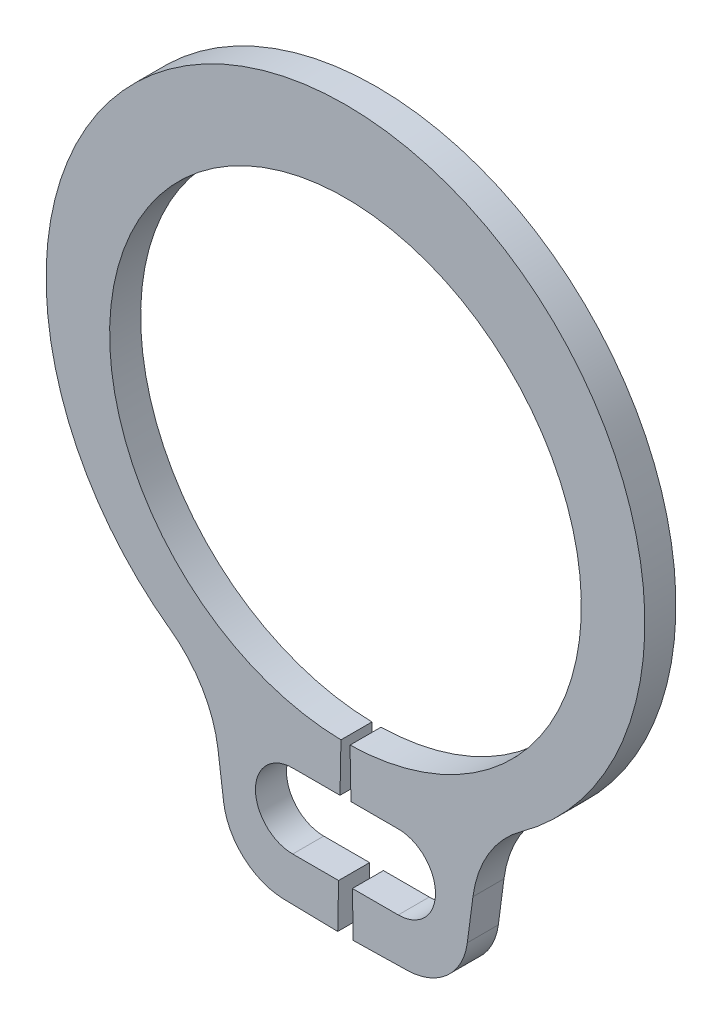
from build123d import *

# Parameters (mm, degrees)
BODYSKE_R   = 0.3
BODY_DEPTH  = 0.25
NOTSKE_W    = 0.85
NOTSKE_H    = 0.6
NOTCH_DEPTH = 5.054243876


with BuildPart() as part:
    # BodySke → Body (new body)
    with BuildSketch(Plane.XY):
        with BuildLine():
            Line((0.036538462, -1.899648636), (0.0625, -3.249398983))
            Line((0.0625, -3.249398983), (0.495236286, -3.241075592))
            ThreePointArc((0.495236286, -3.241075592), (0.818893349, -3.113900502), (0.981343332, -2.806431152))
            Line((0.981343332, -2.806431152), (1.026638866, -2.462377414))
            ThreePointArc((1.026638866, -2.462377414), (1.152695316, -2.099674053), (1.412082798, -1.816544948))
            ThreePointArc((1.412082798, -1.816544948), (0, 2.55), (-1.412082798, -1.816544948))
            ThreePointArc((-1.412082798, -1.816544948), (-1.152695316, -2.099674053), (-1.026638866, -2.462377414))
            Line((-1.026638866, -2.462377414), (-0.981343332, -2.806431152))
            ThreePointArc((-0.981343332, -2.806431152), (-0.818893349, -3.113900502), (-0.495236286, -3.241075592))
            Line((-0.495236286, -3.241075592), (-0.0625, -3.249398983))
            Line((-0.0625, -3.249398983), (-0.036538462, -1.899648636))
            ThreePointArc((-0.036538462, -1.899648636), (0, 1.9), (0.036538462, -1.899648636))
        make_face()
        with Locations((0.425, -2.590366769)):
            Circle(BODYSKE_R, mode=Mode.SUBTRACT)
        with Locations((-0.425, -2.590366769)):
            Circle(BODYSKE_R, mode=Mode.SUBTRACT)
    extrude(amount=-BODY_DEPTH)

    # NotSke → Notch (cut, through all)
    with BuildSketch(Plane.XY):
        with Locations((0, -2.590366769)):
            Rectangle(NOTSKE_W, NOTSKE_H)
    extrude(amount=-NOTCH_DEPTH, mode=Mode.SUBTRACT)


solid = part.part
